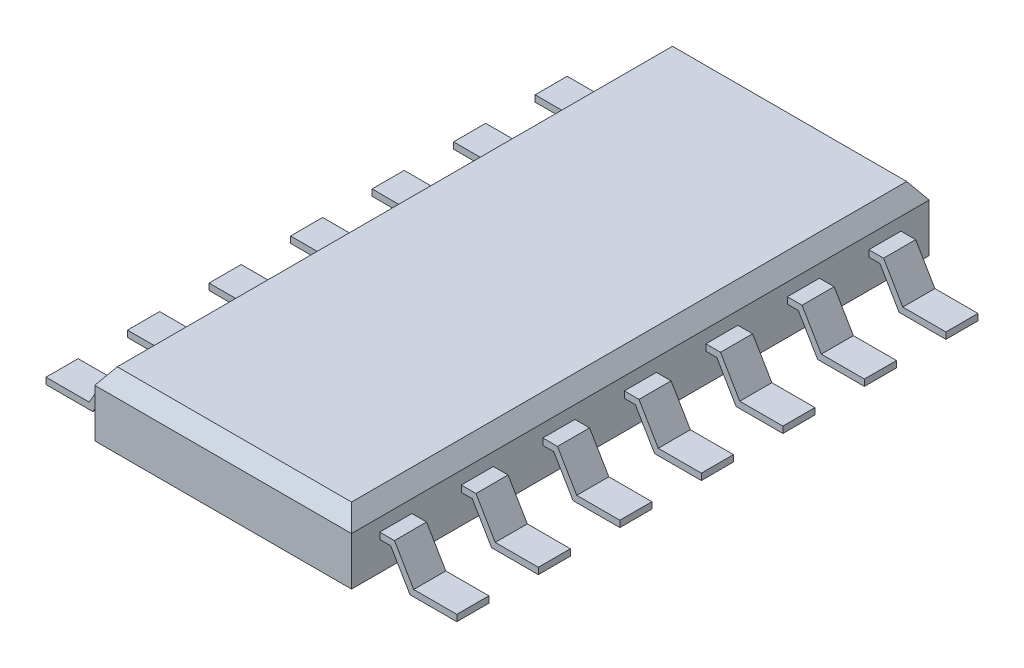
from build123d import *
from OCP.BRepFilletAPI import BRepFilletAPI_MakeChamfer

# Parameters (mm, degrees)
SKETCH1_W            = 4
SKETCH1_H            = 8.999687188
EXTRUDE1_DEPTH       = 0.5
CHAMFER1_SIZE        = 0.25
CHAMFER1_SIZE2       = 0.175051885
EXTRUDE_THIN1_DEPTH  = 0.25
LPATTERN1_COUNT      = 4
LPATTERN1_PITCH      = 1.27
LPATTERN1_COL_COUNT  = 4
LPATTERN1_COL_PITCH  = 1.27
MIRROR1_COPY_1_DEPTH = 0.25
MIRROR1_COPY_2_DEPTH = 0.25
MIRROR1_COPY_3_DEPTH = 0.25
MIRROR1_COPY_4_DEPTH = 0.25
MIRROR1_COPY_5_DEPTH = 0.25
MIRROR1_COPY_6_DEPTH = 0.25


with BuildPart() as part:
    # Sketch1 → Extrude1 (new, symmetric)
    with BuildSketch(Plane(origin=(0, 0, 0), x_dir=(1, 0, 0), z_dir=(0, 1, 0))):
        Rectangle(SKETCH1_W, SKETCH1_H)
    extrude(amount=EXTRUDE1_DEPTH, both=True)

    # Chamfer1: one chamfer whose edges measure the first distance from different faces: ONE call of the kernel's chamfer builder (chamfer() names one face for all edges)
    chamfer1_edges_1 = [part.edges().sort_by_distance(p)[0] for p in [
        (2, 0.5, 0),
    ]]
    chamfer1_side_1 = [part.faces().sort_by_distance(p)[0] for p in [
        (2, 0, 0),
    ]]
    chamfer1_edges_2 = [part.edges().sort_by_distance(p)[0] for p in [
        (0, 0.5, -4.499843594),
    ]]
    chamfer1_side_2 = [part.faces().sort_by_distance(p)[0] for p in [
        (0, 0, -4.499843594),
    ]]
    chamfer1_edges_3 = [part.edges().sort_by_distance(p)[0] for p in [
        (-2, 0.5, 0),
    ]]
    chamfer1_side_3 = [part.faces().sort_by_distance(p)[0] for p in [
        (-2, 0, 0),
    ]]
    chamfer1_edges_4 = [part.edges().sort_by_distance(p)[0] for p in [
        (0, 0.5, 4.499843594),
    ]]
    chamfer1_side_4 = [part.faces().sort_by_distance(p)[0] for p in [
        (0, 0, 4.499843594),
    ]]
    chamfer1 = BRepFilletAPI_MakeChamfer(part.part.solid().wrapped)
    for e in chamfer1_edges_1:
        chamfer1.Add(CHAMFER1_SIZE, CHAMFER1_SIZE2, e.wrapped, chamfer1_side_1[0].wrapped)  # the first distance lies on this face
    for e in chamfer1_edges_2:
        chamfer1.Add(CHAMFER1_SIZE, CHAMFER1_SIZE2, e.wrapped, chamfer1_side_2[0].wrapped)  # the first distance lies on this face
    for e in chamfer1_edges_3:
        chamfer1.Add(CHAMFER1_SIZE, CHAMFER1_SIZE2, e.wrapped, chamfer1_side_3[0].wrapped)  # the first distance lies on this face
    for e in chamfer1_edges_4:
        chamfer1.Add(CHAMFER1_SIZE, CHAMFER1_SIZE2, e.wrapped, chamfer1_side_4[0].wrapped)  # the first distance lies on this face
    add(Compound.cast(chamfer1.Shape()), mode=Mode.REPLACE)

    # Sketch4 → Extrude-Thin1 (add, symmetric)
    with BuildSketch(Plane.XY):
        Polygon((-2, 0.05), (-2.228597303, 0.05), (-2.528597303, -0.46), (-3.2, -0.46), (-3.2, -0.56), (-2.471402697, -0.56), (-2.171402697, -0.05), (-2, -0.05), align=None)
    extrude_thin1 = extrude(amount=EXTRUDE_THIN1_DEPTH, both=True)

    # LPattern1: Extrude-Thin1 ×4
    with Locations(*[(0, 0, -i * LPATTERN1_PITCH) for i in range(1, LPATTERN1_COUNT)]):
        add(extrude_thin1)

    # LPattern1 col: Extrude-Thin1 ×4
    with Locations(*[(0, 0, i * LPATTERN1_COL_PITCH) for i in range(1, LPATTERN1_COL_COUNT)]):
        add(extrude_thin1)

    # Mirror1: Extrude-Thin1 across plane
    add(extrude_thin1.mirror(Plane(origin=(0, 0, 0), x_dir=(0, 0, 1), z_dir=(1, 0, 0))))

    # Mirror1 copy 1 sketch → Mirror1 copy 1 (add, symmetric)
    with BuildSketch(Plane(origin=(0, 0, -1.27), x_dir=(-1, 0, 0), z_dir=(0, 0, 1))):
        Polygon((-2, -0.05), (-2.228597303, -0.05), (-2.528597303, 0.46), (-3.2, 0.46), (-3.2, 0.56), (-2.471402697, 0.56), (-2.171402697, 0.05), (-2, 0.05), align=None)
    extrude(amount=MIRROR1_COPY_1_DEPTH, both=True)

    # Mirror1 copy 2 sketch → Mirror1 copy 2 (add, symmetric)
    with BuildSketch(Plane(origin=(0, 0, -2.54), x_dir=(-1, 0, 0), z_dir=(0, 0, 1))):
        Polygon((-2, -0.05), (-2.228597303, -0.05), (-2.528597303, 0.46), (-3.2, 0.46), (-3.2, 0.56), (-2.471402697, 0.56), (-2.171402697, 0.05), (-2, 0.05), align=None)
    extrude(amount=MIRROR1_COPY_2_DEPTH, both=True)

    # Mirror1 copy 3 sketch → Mirror1 copy 3 (add, symmetric)
    with BuildSketch(Plane(origin=(0, 0, -3.81), x_dir=(-1, 0, 0), z_dir=(0, 0, 1))):
        Polygon((-2, -0.05), (-2.228597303, -0.05), (-2.528597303, 0.46), (-3.2, 0.46), (-3.2, 0.56), (-2.471402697, 0.56), (-2.171402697, 0.05), (-2, 0.05), align=None)
    extrude(amount=MIRROR1_COPY_3_DEPTH, both=True)

    # Mirror1 copy 4 sketch → Mirror1 copy 4 (add, symmetric)
    with BuildSketch(Plane(origin=(0, 0, 1.27), x_dir=(-1, 0, 0), z_dir=(0, 0, 1))):
        Polygon((-2, -0.05), (-2.228597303, -0.05), (-2.528597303, 0.46), (-3.2, 0.46), (-3.2, 0.56), (-2.471402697, 0.56), (-2.171402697, 0.05), (-2, 0.05), align=None)
    extrude(amount=MIRROR1_COPY_4_DEPTH, both=True)

    # Mirror1 copy 5 sketch → Mirror1 copy 5 (add, symmetric)
    with BuildSketch(Plane(origin=(0, 0, 2.54), x_dir=(-1, 0, 0), z_dir=(0, 0, 1))):
        Polygon((-2, -0.05), (-2.228597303, -0.05), (-2.528597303, 0.46), (-3.2, 0.46), (-3.2, 0.56), (-2.471402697, 0.56), (-2.171402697, 0.05), (-2, 0.05), align=None)
    extrude(amount=MIRROR1_COPY_5_DEPTH, both=True)

    # Mirror1 copy 6 sketch → Mirror1 copy 6 (add, symmetric)
    with BuildSketch(Plane(origin=(0, 0, 3.81), x_dir=(-1, 0, 0), z_dir=(0, 0, 1))):
        Polygon((-2, -0.05), (-2.228597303, -0.05), (-2.528597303, 0.46), (-3.2, 0.46), (-3.2, 0.56), (-2.471402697, 0.56), (-2.171402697, 0.05), (-2, 0.05), align=None)
    extrude(amount=MIRROR1_COPY_6_DEPTH, both=True)


solid = part.part
